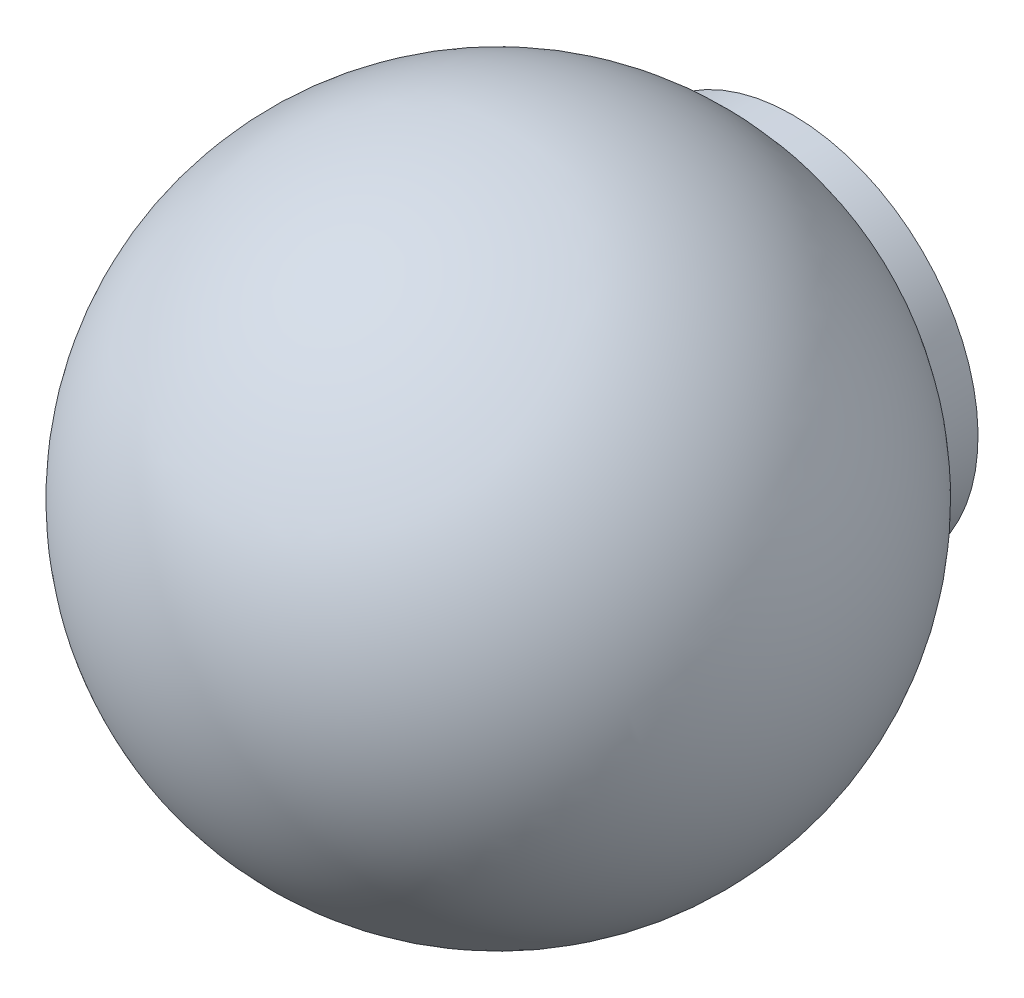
ISO-10303-21;
HEADER;
FILE_DESCRIPTION(('STEP AP214'),'2;1');
FILE_NAME('part.step','',(''),(''),'','','');
FILE_SCHEMA(('AUTOMOTIVE_DESIGN { 1 0 10303 214 1 1 1 1 }'));
ENDSEC;
DATA;
#1=APPLICATION_CONTEXT('core data for automotive mechanical design processes');
#2=APPLICATION_PROTOCOL_DEFINITION('international standard','automotive_design',2000,#1);
#3=PRODUCT_CONTEXT('',#1,'mechanical');
#4=PRODUCT('Part','Part','',(#3));
#5=PRODUCT_RELATED_PRODUCT_CATEGORY('part','',(#4));
#6=PRODUCT_DEFINITION_FORMATION('','',#4);
#7=PRODUCT_DEFINITION_CONTEXT('part definition',#1,'design');
#8=PRODUCT_DEFINITION('design','',#6,#7);
#9=PRODUCT_DEFINITION_SHAPE('','',#8);
#10=(LENGTH_UNIT() NAMED_UNIT(*) SI_UNIT(.MILLI.,.METRE.));
#11=(NAMED_UNIT(*) PLANE_ANGLE_UNIT() SI_UNIT($,.RADIAN.));
#12=(NAMED_UNIT(*) SI_UNIT($,.STERADIAN.) SOLID_ANGLE_UNIT());
#13=UNCERTAINTY_MEASURE_WITH_UNIT(LENGTH_MEASURE(1.E-05),#10,'distance_accuracy_value','');
#14=(GEOMETRIC_REPRESENTATION_CONTEXT(3) GLOBAL_UNCERTAINTY_ASSIGNED_CONTEXT((#13)) GLOBAL_UNIT_ASSIGNED_CONTEXT((#10,
#11,#12)) REPRESENTATION_CONTEXT('',''));
#15=CARTESIAN_POINT('',(0.,0.,0.));
#16=DIRECTION('',(0.,0.,1.));
#17=DIRECTION('',(1.,0.,0.));
#18=AXIS2_PLACEMENT_3D('',#15,#16,#17);
#19=CARTESIAN_POINT('',(2.1094237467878E-12,0.,11.4999999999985));
#20=DIRECTION('',(0.,0.,-1.));
#21=DIRECTION('',(1.,0.,0.));
#22=AXIS2_PLACEMENT_3D('',#19,#20,#21);
#23=SPHERICAL_SURFACE('',#22,12.5);
#24=CARTESIAN_POINT('',(0.,0.,1.31729407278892));
#25=DIRECTION('',(0.,0.,-1.));
#26=DIRECTION('',(0.,1.,0.));
#27=AXIS2_PLACEMENT_3D('',#24,#25,#26);
#28=CIRCLE('',#27,7.2500000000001);
#29=CARTESIAN_POINT('',(0.,7.2500000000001,1.31729407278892));
#30=VERTEX_POINT('',#29);
#31=EDGE_CURVE('E18',#30,#30,#28,.T.);
#32=ORIENTED_EDGE('',*,*,#31,.F.);
#33=EDGE_LOOP('',(#32));
#34=FACE_BOUND('',#33,.T.);
#35=ADVANCED_FACE('F12',(#34),#23,.T.);
#36=CARTESIAN_POINT('',(0.,0.,0.));
#37=DIRECTION('',(0.,0.,-1.));
#38=DIRECTION('',(0.,1.,0.));
#39=AXIS2_PLACEMENT_3D('',#36,#37,#38);
#40=PLANE('',#39);
#41=CARTESIAN_POINT('',(0.,0.,0.));
#42=DIRECTION('',(0.,0.,-1.));
#43=DIRECTION('',(0.,1.,0.));
#44=AXIS2_PLACEMENT_3D('',#41,#42,#43);
#45=CIRCLE('',#44,4.);
#46=CARTESIAN_POINT('',(0.,4.,0.));
#47=VERTEX_POINT('',#46);
#48=EDGE_CURVE('E26',#47,#47,#45,.T.);
#49=ORIENTED_EDGE('',*,*,#48,.F.);
#50=EDGE_LOOP('',(#49));
#51=FACE_BOUND('',#50,.T.);
#52=CARTESIAN_POINT('',(0.,0.,0.));
#53=DIRECTION('',(0.,0.,-1.));
#54=DIRECTION('',(0.,1.,0.));
#55=AXIS2_PLACEMENT_3D('',#52,#53,#54);
#56=CIRCLE('',#55,7.2500000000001);
#57=CARTESIAN_POINT('',(0.,7.2500000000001,0.));
#58=VERTEX_POINT('',#57);
#59=EDGE_CURVE('E8',#58,#58,#56,.T.);
#60=ORIENTED_EDGE('',*,*,#59,.T.);
#61=EDGE_LOOP('',(#60));
#62=FACE_BOUND('',#61,.T.);
#63=ADVANCED_FACE('F34',(#51,#62),#40,.T.);
#64=CARTESIAN_POINT('',(0.,0.,0.));
#65=DIRECTION('',(0.,0.,-1.));
#66=DIRECTION('',(0.,1.,0.));
#67=AXIS2_PLACEMENT_3D('',#64,#65,#66);
#68=CYLINDRICAL_SURFACE('',#67,7.2500000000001);
#69=ORIENTED_EDGE('',*,*,#31,.T.);
#70=EDGE_LOOP('',(#69));
#71=FACE_BOUND('',#70,.T.);
#72=ORIENTED_EDGE('',*,*,#59,.F.);
#73=EDGE_LOOP('',(#72));
#74=FACE_BOUND('',#73,.T.);
#75=ADVANCED_FACE('F36',(#71,#74),#68,.T.);
#76=CARTESIAN_POINT('',(0.,0.,12.));
#77=DIRECTION('',(0.,0.,-1.));
#78=DIRECTION('',(0.,1.,0.));
#79=AXIS2_PLACEMENT_3D('',#76,#77,#78);
#80=CYLINDRICAL_SURFACE('',#79,4.);
#81=CARTESIAN_POINT('',(0.,0.,12.));
#82=DIRECTION('',(0.,0.,-1.));
#83=DIRECTION('',(0.,1.,0.));
#84=AXIS2_PLACEMENT_3D('',#81,#82,#83);
#85=CIRCLE('',#84,4.);
#86=CARTESIAN_POINT('',(0.,4.,12.));
#87=VERTEX_POINT('',#86);
#88=EDGE_CURVE('E22',#87,#87,#85,.T.);
#89=ORIENTED_EDGE('',*,*,#88,.F.);
#90=EDGE_LOOP('',(#89));
#91=FACE_BOUND('',#90,.T.);
#92=ORIENTED_EDGE('',*,*,#48,.T.);
#93=EDGE_LOOP('',(#92));
#94=FACE_BOUND('',#93,.T.);
#95=ADVANCED_FACE('F32',(#91,#94),#80,.F.);
#96=CARTESIAN_POINT('',(0.,0.,12.));
#97=DIRECTION('',(0.,0.,-1.));
#98=DIRECTION('',(0.,1.,0.));
#99=AXIS2_PLACEMENT_3D('',#96,#97,#98);
#100=PLANE('',#99);
#101=ORIENTED_EDGE('',*,*,#88,.T.);
#102=EDGE_LOOP('',(#101));
#103=FACE_BOUND('',#102,.T.);
#104=ADVANCED_FACE('F48',(#103),#100,.T.);
#105=CLOSED_SHELL('',(#35,#63,#75,#95,#104));
#106=MANIFOLD_SOLID_BREP('B1',#105);
#107=ADVANCED_BREP_SHAPE_REPRESENTATION('',(#18,#106),#14);
#108=SHAPE_DEFINITION_REPRESENTATION(#9,#107);
ENDSEC;
END-ISO-10303-21;
